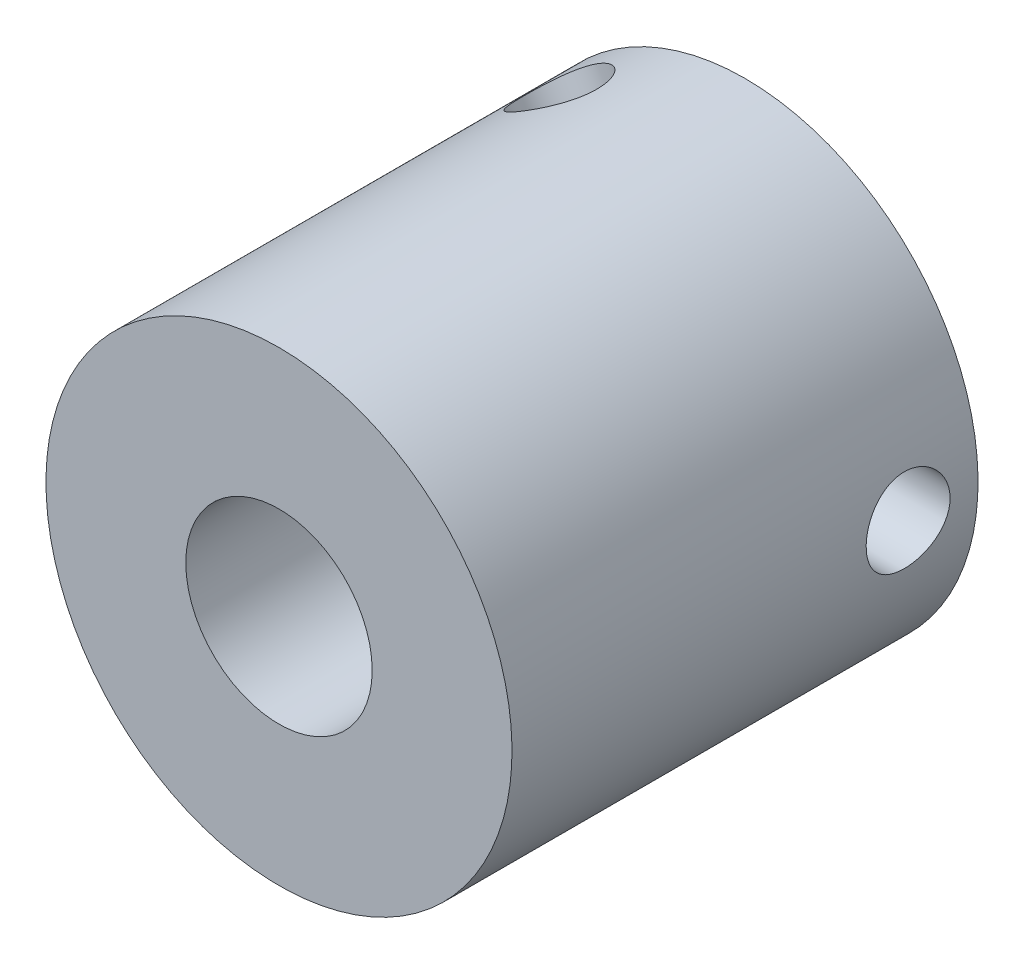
ISO-10303-21;
HEADER;
FILE_DESCRIPTION(('STEP AP214'),'2;1');
FILE_NAME('part.step','',(''),(''),'','','');
FILE_SCHEMA(('AUTOMOTIVE_DESIGN { 1 0 10303 214 1 1 1 1 }'));
ENDSEC;
DATA;
#1=APPLICATION_CONTEXT('core data for automotive mechanical design processes');
#2=APPLICATION_PROTOCOL_DEFINITION('international standard','automotive_design',2000,#1);
#3=PRODUCT_CONTEXT('',#1,'mechanical');
#4=PRODUCT('Part','Part','',(#3));
#5=PRODUCT_RELATED_PRODUCT_CATEGORY('part','',(#4));
#6=PRODUCT_DEFINITION_FORMATION('','',#4);
#7=PRODUCT_DEFINITION_CONTEXT('part definition',#1,'design');
#8=PRODUCT_DEFINITION('design','',#6,#7);
#9=PRODUCT_DEFINITION_SHAPE('','',#8);
#10=(LENGTH_UNIT() NAMED_UNIT(*) SI_UNIT(.MILLI.,.METRE.));
#11=(NAMED_UNIT(*) PLANE_ANGLE_UNIT() SI_UNIT($,.RADIAN.));
#12=(NAMED_UNIT(*) SI_UNIT($,.STERADIAN.) SOLID_ANGLE_UNIT());
#13=UNCERTAINTY_MEASURE_WITH_UNIT(LENGTH_MEASURE(1.E-05),#10,'distance_accuracy_value','');
#14=(GEOMETRIC_REPRESENTATION_CONTEXT(3) GLOBAL_UNCERTAINTY_ASSIGNED_CONTEXT((#13)) GLOBAL_UNIT_ASSIGNED_CONTEXT((#10,
#11,#12)) REPRESENTATION_CONTEXT('',''));
#15=CARTESIAN_POINT('',(0.,0.,0.));
#16=DIRECTION('',(0.,0.,1.));
#17=DIRECTION('',(1.,0.,0.));
#18=AXIS2_PLACEMENT_3D('',#15,#16,#17);
#19=CARTESIAN_POINT('',(0.,0.,-16.9705627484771));
#20=DIRECTION('',(0.,0.,1.));
#21=DIRECTION('',(1.,0.,0.));
#22=AXIS2_PLACEMENT_3D('',#19,#20,#21);
#23=CYLINDRICAL_SURFACE('',#22,4.);
#24=CARTESIAN_POINT('',(0.,0.,0.));
#25=DIRECTION('',(0.,0.,1.));
#26=DIRECTION('',(1.,0.,0.));
#27=AXIS2_PLACEMENT_3D('',#24,#25,#26);
#28=CIRCLE('',#27,4.);
#29=CARTESIAN_POINT('',(4.,0.,0.));
#30=VERTEX_POINT('',#29);
#31=EDGE_CURVE('E37',#30,#30,#28,.F.);
#32=ORIENTED_EDGE('',*,*,#31,.T.);
#33=EDGE_LOOP('',(#32));
#34=FACE_BOUND('',#33,.T.);
#35=CARTESIAN_POINT('',(0.,0.,20.));
#36=DIRECTION('',(0.,0.,1.));
#37=DIRECTION('',(1.,0.,0.));
#38=AXIS2_PLACEMENT_3D('',#35,#36,#37);
#39=CIRCLE('',#38,4.);
#40=CARTESIAN_POINT('',(4.,0.,20.));
#41=VERTEX_POINT('',#40);
#42=EDGE_CURVE('E70',#41,#41,#39,.T.);
#43=ORIENTED_EDGE('',*,*,#42,.T.);
#44=EDGE_LOOP('',(#43));
#45=FACE_BOUND('',#44,.T.);
#46=CARTESIAN_POINT('',(4.,0.,1.2));
#47=CARTESIAN_POINT('',(3.99999614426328,-0.0957257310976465,1.20000467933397));
#48=CARTESIAN_POINT('',(3.99652545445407,-0.191597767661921,1.20768115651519));
#49=CARTESIAN_POINT('',(3.98298685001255,-0.380576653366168,1.23807960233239));
#50=CARTESIAN_POINT('',(3.9729033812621,-0.473676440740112,1.26083704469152));
#51=CARTESIAN_POINT('',(3.94720826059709,-0.654078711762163,1.32036661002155));
#52=CARTESIAN_POINT('',(3.93161653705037,-0.741400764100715,1.35708824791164));
#53=CARTESIAN_POINT('',(3.89638931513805,-0.908546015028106,1.44327495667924));
#54=CARTESIAN_POINT('',(3.87675467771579,-0.988370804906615,1.49273731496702));
#55=CARTESIAN_POINT('',(3.83412363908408,-1.14291333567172,1.60594379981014));
#56=CARTESIAN_POINT('',(3.81100581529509,-1.21715266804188,1.67029477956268));
#57=CARTESIAN_POINT('',(3.7644874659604,-1.35420914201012,1.81016191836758));
#58=CARTESIAN_POINT('',(3.7410867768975,-1.41701930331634,1.88568484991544));
#59=CARTESIAN_POINT('',(3.69507447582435,-1.53315347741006,2.05118303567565));
#60=CARTESIAN_POINT('',(3.67259284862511,-1.58568979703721,2.14175112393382));
#61=CARTESIAN_POINT('',(3.6329325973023,-1.67457061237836,2.33158516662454));
#62=CARTESIAN_POINT('',(3.61575080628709,-1.71092478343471,2.43084588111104));
#63=CARTESIAN_POINT('',(3.5899719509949,-1.76435376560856,2.62975457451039));
#64=CARTESIAN_POINT('',(3.58096510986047,-1.78235522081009,2.72909825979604));
#65=CARTESIAN_POINT('',(3.57140297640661,-1.80144593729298,2.92977232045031));
#66=CARTESIAN_POINT('',(3.57084181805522,-1.80254693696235,3.03110126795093));
#67=CARTESIAN_POINT('',(3.5778937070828,-1.7884953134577,3.22286555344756));
#68=CARTESIAN_POINT('',(3.58475751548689,-1.77483260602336,3.31344356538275));
#69=CARTESIAN_POINT('',(3.6046018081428,-1.7341718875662,3.49084958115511));
#70=CARTESIAN_POINT('',(3.61758371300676,-1.70717077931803,3.57767670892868));
#71=CARTESIAN_POINT('',(3.64850272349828,-1.64006511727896,3.74747093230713));
#72=CARTESIAN_POINT('',(3.66654531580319,-1.59967786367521,3.83030621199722));
#73=CARTESIAN_POINT('',(3.70553830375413,-1.50715060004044,3.98837927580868));
#74=CARTESIAN_POINT('',(3.72648993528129,-1.45500558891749,4.06361380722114));
#75=CARTESIAN_POINT('',(3.77148635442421,-1.33432905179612,4.21228053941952));
#76=CARTESIAN_POINT('',(3.79563079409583,-1.26467952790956,4.28477790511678));
#77=CARTESIAN_POINT('',(3.84254971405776,-1.11401728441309,4.41740666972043));
#78=CARTESIAN_POINT('',(3.86532375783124,-1.03300097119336,4.47753414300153));
#79=CARTESIAN_POINT('',(3.90781142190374,-0.858658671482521,4.58541102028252));
#80=CARTESIAN_POINT('',(3.92740837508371,-0.765029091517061,4.63271925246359));
#81=CARTESIAN_POINT('',(3.96040579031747,-0.570031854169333,4.71057437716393));
#82=CARTESIAN_POINT('',(3.97381025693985,-0.468669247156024,4.74113210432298));
#83=CARTESIAN_POINT('',(3.99212554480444,-0.268840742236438,4.78252160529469));
#84=CARTESIAN_POINT('',(3.99757364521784,-0.170683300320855,4.79460408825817));
#85=CARTESIAN_POINT('',(4.00112518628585,0.0264022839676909,4.80250349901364));
#86=CARTESIAN_POINT('',(3.99923120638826,0.125330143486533,4.79832613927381));
#87=CARTESIAN_POINT('',(3.98864978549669,0.314885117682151,4.77466197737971));
#88=CARTESIAN_POINT('',(3.98037602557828,0.405654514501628,4.75610710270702));
#89=CARTESIAN_POINT('',(3.95834128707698,0.582660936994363,4.70557349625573));
#90=CARTESIAN_POINT('',(3.94457964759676,0.66889741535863,4.67359314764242));
#91=CARTESIAN_POINT('',(3.91232476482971,0.837442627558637,4.59610836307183));
#92=CARTESIAN_POINT('',(3.89369761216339,0.919545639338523,4.55021406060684));
#93=CARTESIAN_POINT('',(3.85362888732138,1.07518043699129,4.44662892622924));
#94=CARTESIAN_POINT('',(3.83218608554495,1.14870845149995,4.38893293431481));
#95=CARTESIAN_POINT('',(3.78656870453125,1.29149865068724,4.2578477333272));
#96=CARTESIAN_POINT('',(3.76231462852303,1.35990988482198,4.18355706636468));
#97=CARTESIAN_POINT('',(3.71528573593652,1.48359021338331,4.02427154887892));
#98=CARTESIAN_POINT('',(3.69251148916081,1.53885426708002,3.93927261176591));
#99=CARTESIAN_POINT('',(3.65057841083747,1.63589501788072,3.75807040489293));
#100=CARTESIAN_POINT('',(3.63152701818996,1.67729036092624,3.66163606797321));
#101=CARTESIAN_POINT('',(3.60052790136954,1.74285314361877,3.46202689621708));
#102=CARTESIAN_POINT('',(3.58857300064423,1.76703799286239,3.35885898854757));
#103=CARTESIAN_POINT('',(3.57434222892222,1.79563623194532,3.1582820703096));
#104=CARTESIAN_POINT('',(3.57132092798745,1.80157406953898,3.06114311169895));
#105=CARTESIAN_POINT('',(3.57326614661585,1.79771412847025,2.86727148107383));
#106=CARTESIAN_POINT('',(3.57823084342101,1.78791994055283,2.770538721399));
#107=CARTESIAN_POINT('',(3.59486173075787,1.75421876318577,2.58658574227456));
#108=CARTESIAN_POINT('',(3.60608465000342,1.73124262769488,2.49915066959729));
#109=CARTESIAN_POINT('',(3.63354977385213,1.67282749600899,2.32939442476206));
#110=CARTESIAN_POINT('',(3.64979343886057,1.63738487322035,2.24707474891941));
#111=CARTESIAN_POINT('',(3.686767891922,1.55242316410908,2.08404593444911));
#112=CARTESIAN_POINT('',(3.70772103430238,1.50214155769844,2.00378577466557));
#113=CARTESIAN_POINT('',(3.75123798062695,1.38990450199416,1.85236964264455));
#114=CARTESIAN_POINT('',(3.77380247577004,1.32794402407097,1.78121761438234));
#115=CARTESIAN_POINT('',(3.82045170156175,1.1874770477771,1.64337390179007));
#116=CARTESIAN_POINT('',(3.84448894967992,1.10798007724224,1.5776703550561));
#117=CARTESIAN_POINT('',(3.88939150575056,0.938258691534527,1.46042031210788));
#118=CARTESIAN_POINT('',(3.91025535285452,0.848029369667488,1.40888032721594));
#119=CARTESIAN_POINT('',(3.94631359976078,0.660057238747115,1.3222244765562));
#120=CARTESIAN_POINT('',(3.96156247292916,0.562398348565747,1.28694991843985));
#121=CARTESIAN_POINT('',(3.98487136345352,0.361825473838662,1.23370953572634));
#122=CARTESIAN_POINT('',(3.99295317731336,0.258928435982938,1.21569121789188));
#123=CARTESIAN_POINT('',(3.99798889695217,0.129468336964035,1.20447371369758));
#124=CARTESIAN_POINT('',(3.99874171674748,0.10361201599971,1.20279769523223));
#125=CARTESIAN_POINT('',(3.99974779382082,0.0518407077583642,1.20056019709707));
#126=CARTESIAN_POINT('',(4.00000104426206,0.0259257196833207,1.19999873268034));
#127=CARTESIAN_POINT('',(4.,0.,1.2));
#128=B_SPLINE_CURVE_WITH_KNOTS('',3,(#46,#47,#48,#49,#50,#51,#52,#53,#54,#55,#56,#57,#58,#59,
#60,#61,#62,#63,#64,#65,#66,#67,#68,#69,#70,#71,#72,#73,#74,#75,#76,#77,#78,#79,#80,#81,#82,#83,
#84,#85,#86,#87,#88,#89,#90,#91,#92,#93,#94,#95,#96,#97,#98,#99,#100,#101,#102,#103,#104,#105,
#106,#107,#108,#109,#110,#111,#112,#113,#114,#115,#116,#117,#118,#119,#120,#121,#122,#123,#124,
#125,#126,#127),.UNSPECIFIED.,.T.,.F.,(4,2,2,2,2,2,2,2,2,2,2,2,2,2,2,2,2,2,2,2,2,2,2,2,2,2,2,2,
2,2,2,2,2,2,2,2,2,2,2,2,4),(0.,0.28707077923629,0.574819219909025,0.861537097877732,
1.14819398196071,1.44969271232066,1.75137496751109,2.0710233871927,2.39048043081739,
2.69286202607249,2.9950335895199,3.26933192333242,3.54369398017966,3.82426477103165,
4.1049551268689,4.41375209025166,4.72264690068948,5.04111110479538,5.35936907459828,
5.65494364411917,5.9504143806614,6.22818822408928,6.50599552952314,6.79244743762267,
7.07902485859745,7.38921990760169,7.69953369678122,8.01778885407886,8.33572161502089,
8.62625158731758,8.91671525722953,9.18882532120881,9.461014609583,9.75081852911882,
10.0407475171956,10.3569438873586,10.6732853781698,10.9864715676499,11.2987019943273,
11.3764492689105,11.4541976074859),.UNSPECIFIED.);
#129=CARTESIAN_POINT('',(4.,0.,1.2));
#130=VERTEX_POINT('',#129);
#131=EDGE_CURVE('E56',#130,#130,#128,.T.);
#132=ORIENTED_EDGE('',*,*,#131,.F.);
#133=EDGE_LOOP('',(#132));
#134=FACE_BOUND('',#133,.T.);
#135=CARTESIAN_POINT('',(-0.227211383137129,3.9935416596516,3.));
#136=CARTESIAN_POINT('',(-0.227218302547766,3.99354391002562,3.09517059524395));
#137=CARTESIAN_POINT('',(-0.235719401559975,3.99308546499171,3.19049226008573));
#138=CARTESIAN_POINT('',(-0.269169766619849,3.99096656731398,3.37831810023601));
#139=CARTESIAN_POINT('',(-0.294160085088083,3.98930311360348,3.47081463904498));
#140=CARTESIAN_POINT('',(-0.358881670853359,3.98399837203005,3.64993289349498));
#141=CARTESIAN_POINT('',(-0.39854601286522,3.9803660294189,3.73657920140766));
#142=CARTESIAN_POINT('',(-0.490604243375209,3.97006866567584,3.90255257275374));
#143=CARTESIAN_POINT('',(-0.542996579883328,3.96340401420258,3.98188052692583));
#144=CARTESIAN_POINT('',(-0.662276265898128,3.94528306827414,4.13678782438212));
#145=CARTESIAN_POINT('',(-0.729893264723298,3.93353893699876,4.21177195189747));
#146=CARTESIAN_POINT('',(-0.874829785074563,3.90386266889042,4.35031925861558));
#147=CARTESIAN_POINT('',(-0.952153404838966,3.88592791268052,4.41387758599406));
#148=CARTESIAN_POINT('',(-1.1182542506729,3.84151862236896,4.53098864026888));
#149=CARTESIAN_POINT('',(-1.20741827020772,3.81464794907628,4.58384780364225));
#150=CARTESIAN_POINT('',(-1.39055829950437,3.7517592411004,4.67330158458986));
#151=CARTESIAN_POINT('',(-1.48453180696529,3.71574592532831,4.70990456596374));
#152=CARTESIAN_POINT('',(-1.668113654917,3.63686341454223,4.76357498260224));
#153=CARTESIAN_POINT('',(-1.75764896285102,3.59452975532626,4.78167535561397));
#154=CARTESIAN_POINT('',(-1.93467213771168,3.5024248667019,4.80118884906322));
#155=CARTESIAN_POINT('',(-2.02216096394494,3.45265720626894,4.80260995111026));
#156=CARTESIAN_POINT('',(-2.18611064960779,3.35105482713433,4.7892123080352));
#157=CARTESIAN_POINT('',(-2.26291377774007,3.29961566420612,4.77553576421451));
#158=CARTESIAN_POINT('',(-2.41031617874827,3.19352854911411,4.7343214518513));
#159=CARTESIAN_POINT('',(-2.48091499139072,3.13888035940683,4.70678265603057));
#160=CARTESIAN_POINT('',(-2.61560739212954,3.02759850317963,4.63833755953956));
#161=CARTESIAN_POINT('',(-2.67958588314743,2.97094728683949,4.5972345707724));
#162=CARTESIAN_POINT('',(-2.79905444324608,2.85867535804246,4.50304296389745));
#163=CARTESIAN_POINT('',(-2.85454139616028,2.80305503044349,4.44994996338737));
#164=CARTESIAN_POINT('',(-2.96080426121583,2.69074060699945,4.32835533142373));
#165=CARTESIAN_POINT('',(-3.01084529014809,2.63431824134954,4.25895934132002));
#166=CARTESIAN_POINT('',(-3.10056968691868,2.5281043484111,4.1091941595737));
#167=CARTESIAN_POINT('',(-3.14024764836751,2.47831628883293,4.0288192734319));
#168=CARTESIAN_POINT('',(-3.21072923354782,2.38636246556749,3.85501145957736));
#169=CARTESIAN_POINT('',(-3.24107063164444,2.34462356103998,3.76116205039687));
#170=CARTESIAN_POINT('',(-3.29033955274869,2.27497393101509,3.5656687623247));
#171=CARTESIAN_POINT('',(-3.30927678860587,2.24705144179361,3.46403159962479));
#172=CARTESIAN_POINT('',(-3.33466604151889,2.20918303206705,3.26360500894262));
#173=CARTESIAN_POINT('',(-3.34191671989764,2.19809055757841,3.16513489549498));
#174=CARTESIAN_POINT('',(-3.346388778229,2.19127950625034,2.96745655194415));
#175=CARTESIAN_POINT('',(-3.34361471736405,2.19555394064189,2.86824867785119));
#176=CARTESIAN_POINT('',(-3.32871118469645,2.21806943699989,2.6803198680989));
#177=CARTESIAN_POINT('',(-3.31734870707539,2.23516460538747,2.59139535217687));
#178=CARTESIAN_POINT('',(-3.28627752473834,2.28059896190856,2.41800027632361));
#179=CARTESIAN_POINT('',(-3.26656663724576,2.30894109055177,2.33353088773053));
#180=CARTESIAN_POINT('',(-3.21780525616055,2.37645363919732,2.1671614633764));
#181=CARTESIAN_POINT('',(-3.18837349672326,2.41605492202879,2.08554930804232));
#182=CARTESIAN_POINT('',(-3.12051504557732,2.50308375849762,1.93065310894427));
#183=CARTESIAN_POINT('',(-3.08208406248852,2.55051504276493,1.85737306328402));
#184=CARTESIAN_POINT('',(-2.9920101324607,2.65577152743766,1.71373956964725));
#185=CARTESIAN_POINT('',(-2.93944223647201,2.71415965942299,1.64437448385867));
#186=CARTESIAN_POINT('',(-2.82356538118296,2.83451073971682,1.51893876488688));
#187=CARTESIAN_POINT('',(-2.76025473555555,2.89647424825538,1.46287022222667));
#188=CARTESIAN_POINT('',(-2.62272212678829,3.02159644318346,1.3652830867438));
#189=CARTESIAN_POINT('',(-2.54839776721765,3.08476088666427,1.32391497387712));
#190=CARTESIAN_POINT('',(-2.39065699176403,3.20854811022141,1.25825900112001));
#191=CARTESIAN_POINT('',(-2.30724703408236,3.26917265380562,1.23395909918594));
#192=CARTESIAN_POINT('',(-2.14051533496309,3.38044961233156,1.20482316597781));
#193=CARTESIAN_POINT('',(-2.05770803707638,3.43151149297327,1.19860012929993));
#194=CARTESIAN_POINT('',(-1.88882018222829,3.52728977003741,1.20192704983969));
#195=CARTESIAN_POINT('',(-1.80274038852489,3.5720076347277,1.21147335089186));
#196=CARTESIAN_POINT('',(-1.63414770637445,3.65210603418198,1.24508188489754));
#197=CARTESIAN_POINT('',(-1.55165419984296,3.6878230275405,1.26845156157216));
#198=CARTESIAN_POINT('',(-1.3886876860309,3.7522300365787,1.32822270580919));
#199=CARTESIAN_POINT('',(-1.30821502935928,3.78091884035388,1.3646264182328));
#200=CARTESIAN_POINT('',(-1.14794735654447,3.8327058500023,1.45125977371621));
#201=CARTESIAN_POINT('',(-1.06835218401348,3.85548782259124,1.50204628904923));
#202=CARTESIAN_POINT('',(-0.916112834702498,3.89447337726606,1.61524486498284));
#203=CARTESIAN_POINT('',(-0.843471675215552,3.91067411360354,1.67766193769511));
#204=CARTESIAN_POINT('',(-0.701783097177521,3.93867104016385,1.81826693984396));
#205=CARTESIAN_POINT('',(-0.633502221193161,3.95000469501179,1.89732236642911));
#206=CARTESIAN_POINT('',(-0.510273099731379,3.96780927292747,2.06582014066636));
#207=CARTESIAN_POINT('',(-0.455333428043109,3.97427707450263,2.15526911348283));
#208=CARTESIAN_POINT('',(-0.36134166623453,3.98392887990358,2.34304751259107));
#209=CARTESIAN_POINT('',(-0.322387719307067,3.98709277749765,2.44142739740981));
#210=CARTESIAN_POINT('',(-0.263587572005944,3.99141790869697,2.64360393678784));
#211=CARTESIAN_POINT('',(-0.243677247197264,3.99258587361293,2.74738116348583));
#212=CARTESIAN_POINT('',(-0.231758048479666,3.99328022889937,2.87652984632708));
#213=CARTESIAN_POINT('',(-0.230055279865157,3.99337897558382,2.90118976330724));
#214=CARTESIAN_POINT('',(-0.227781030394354,3.99350939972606,2.95056305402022));
#215=CARTESIAN_POINT('',(-0.227209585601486,3.99354107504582,2.975276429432));
#216=CARTESIAN_POINT('',(-0.227211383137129,3.9935416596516,3.));
#217=B_SPLINE_CURVE_WITH_KNOTS('',3,(#135,#136,#137,#138,#139,#140,#141,#142,#143,#144,#145,
#146,#147,#148,#149,#150,#151,#152,#153,#154,#155,#156,#157,#158,#159,#160,#161,#162,#163,#164,
#165,#166,#167,#168,#169,#170,#171,#172,#173,#174,#175,#176,#177,#178,#179,#180,#181,#182,#183,
#184,#185,#186,#187,#188,#189,#190,#191,#192,#193,#194,#195,#196,#197,#198,#199,#200,#201,#202,
#203,#204,#205,#206,#207,#208,#209,#210,#211,#212,#213,#214,#215,#216),.UNSPECIFIED.,.T.,.F.,(4,
2,2,2,2,2,2,2,2,2,2,2,2,2,2,2,2,2,2,2,2,2,2,2,2,2,2,2,2,2,2,2,2,2,2,2,2,2,2,2,4),(0.,
0.285407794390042,0.571528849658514,0.856360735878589,1.1411579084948,1.44479681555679,
1.74856435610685,2.06815358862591,2.38757820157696,2.68799375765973,2.98826554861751,
3.26728664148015,3.54632841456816,3.82960860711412,4.11299250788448,4.41910720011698,
4.72538127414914,5.04500587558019,5.36435786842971,5.66078533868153,5.9570780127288,
6.22964286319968,6.50227902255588,6.78721618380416,7.07228949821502,7.38526327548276,
7.6982862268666,8.01442689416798,8.33034429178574,8.62128368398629,8.91215563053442,
9.18956012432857,9.46701241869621,9.75717220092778,10.0474573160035,10.3612338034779,
10.6752114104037,10.9910888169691,11.3058988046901,11.3800401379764,11.4541838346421),.UNSPECIFIED.);
#218=CARTESIAN_POINT('',(-0.227211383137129,3.9935416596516,3.));
#219=VERTEX_POINT('',#218);
#220=EDGE_CURVE('E61',#219,#219,#217,.T.);
#221=ORIENTED_EDGE('',*,*,#220,.F.);
#222=EDGE_LOOP('',(#221));
#223=FACE_BOUND('',#222,.T.);
#224=ADVANCED_FACE('F12',(#34,#45,#134,#223),#23,.F.);
#225=CARTESIAN_POINT('',(10.,0.,3.));
#226=DIRECTION('',(1.,0.,0.));
#227=DIRECTION('',(0.,0.,1.));
#228=AXIS2_PLACEMENT_3D('',#225,#226,#227);
#229=CYLINDRICAL_SURFACE('',#228,1.8);
#230=CARTESIAN_POINT('',(10.,0.,1.2));
#231=CARTESIAN_POINT('',(9.99999792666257,-0.100138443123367,1.20000468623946));
#232=CARTESIAN_POINT('',(9.99847890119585,-0.200403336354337,1.20839204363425));
#233=CARTESIAN_POINT('',(9.99256124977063,-0.398189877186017,1.2417225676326));
#234=CARTESIAN_POINT('',(9.98815683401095,-0.495705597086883,1.26669902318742));
#235=CARTESIAN_POINT('',(9.97696172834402,-0.684989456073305,1.33242473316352));
#236=CARTESIAN_POINT('',(9.9701741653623,-0.776764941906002,1.37315332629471));
#237=CARTESIAN_POINT('',(9.95495763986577,-0.952142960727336,1.46917704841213));
#238=CARTESIAN_POINT('',(9.9465292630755,-1.03574839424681,1.52446698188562));
#239=CARTESIAN_POINT('',(9.92885621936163,-1.19338882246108,1.64870648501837));
#240=CARTESIAN_POINT('',(9.91960421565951,-1.26731946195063,1.7177874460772));
#241=CARTESIAN_POINT('',(9.90138142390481,-1.40261092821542,1.86736851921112));
#242=CARTESIAN_POINT('',(9.89241066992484,-1.46397023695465,1.94787000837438));
#243=CARTESIAN_POINT('',(9.87569637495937,-1.57279517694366,2.11872462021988));
#244=CARTESIAN_POINT('',(9.86796217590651,-1.6201571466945,2.20914476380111));
#245=CARTESIAN_POINT('',(9.85469826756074,-1.69897904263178,2.39681974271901));
#246=CARTESIAN_POINT('',(9.84916836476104,-1.73044036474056,2.49407397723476));
#247=CARTESIAN_POINT('',(9.84101185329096,-1.77623939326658,2.6915561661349));
#248=CARTESIAN_POINT('',(9.8383548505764,-1.79075649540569,2.79174123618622));
#249=CARTESIAN_POINT('',(9.83615323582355,-1.80281159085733,2.99315783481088));
#250=CARTESIAN_POINT('',(9.83660837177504,-1.80035095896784,3.09438927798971));
#251=CARTESIAN_POINT('',(9.84055190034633,-1.77866619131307,3.29373143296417));
#252=CARTESIAN_POINT('',(9.84400352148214,-1.75964526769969,3.39186508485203));
#253=CARTESIAN_POINT('',(9.85349347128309,-1.70569919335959,3.5835259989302));
#254=CARTESIAN_POINT('',(9.85953192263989,-1.67077328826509,3.67705304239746));
#255=CARTESIAN_POINT('',(9.87355429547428,-1.58580593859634,3.85744754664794));
#256=CARTESIAN_POINT('',(9.88154890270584,-1.53568109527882,3.94427486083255));
#257=CARTESIAN_POINT('',(9.89857482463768,-1.42180184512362,4.10835629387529));
#258=CARTESIAN_POINT('',(9.90760615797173,-1.35804719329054,4.18561024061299));
#259=CARTESIAN_POINT('',(9.92584751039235,-1.21763063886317,4.32952111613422));
#260=CARTESIAN_POINT('',(9.93505823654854,-1.14079701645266,4.39601049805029));
#261=CARTESIAN_POINT('',(9.95250580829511,-0.976936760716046,4.51520980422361));
#262=CARTESIAN_POINT('',(9.96074222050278,-0.889905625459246,4.56791360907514));
#263=CARTESIAN_POINT('',(9.97532870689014,-0.707929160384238,4.65806284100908));
#264=CARTESIAN_POINT('',(9.98167520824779,-0.612969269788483,4.69547941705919));
#265=CARTESIAN_POINT('',(9.99172969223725,-0.418096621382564,4.75370936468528));
#266=CARTESIAN_POINT('',(9.99544322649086,-0.318194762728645,4.77455768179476));
#267=CARTESIAN_POINT('',(9.99842222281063,-0.181296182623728,4.79121663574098));
#268=CARTESIAN_POINT('',(9.99901260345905,-0.145122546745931,4.79450767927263));
#269=CARTESIAN_POINT('',(9.99980186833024,-0.0726381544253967,4.7989002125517));
#270=CARTESIAN_POINT('',(10.0000007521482,-0.0363273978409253,4.80000170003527));
#271=CARTESIAN_POINT('',(9.99999792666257,0.100138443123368,4.79999531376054));
#272=CARTESIAN_POINT('',(9.99847890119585,0.200403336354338,4.79160795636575));
#273=CARTESIAN_POINT('',(9.99256124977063,0.398189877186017,4.7582774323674));
#274=CARTESIAN_POINT('',(9.98815683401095,0.495705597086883,4.73330097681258));
#275=CARTESIAN_POINT('',(9.97696172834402,0.684989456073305,4.66757526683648));
#276=CARTESIAN_POINT('',(9.9701741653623,0.776764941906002,4.62684667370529));
#277=CARTESIAN_POINT('',(9.95495763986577,0.952142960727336,4.53082295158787));
#278=CARTESIAN_POINT('',(9.9465292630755,1.03574839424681,4.47553301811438));
#279=CARTESIAN_POINT('',(9.92885621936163,1.19338882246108,4.35129351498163));
#280=CARTESIAN_POINT('',(9.91960421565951,1.26731946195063,4.2822125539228));
#281=CARTESIAN_POINT('',(9.90138142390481,1.40261092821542,4.13263148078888));
#282=CARTESIAN_POINT('',(9.89241066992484,1.46397023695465,4.05212999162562));
#283=CARTESIAN_POINT('',(9.87569637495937,1.57279517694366,3.88127537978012));
#284=CARTESIAN_POINT('',(9.86796217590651,1.6201571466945,3.79085523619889));
#285=CARTESIAN_POINT('',(9.85469826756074,1.69897904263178,3.60318025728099));
#286=CARTESIAN_POINT('',(9.84916836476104,1.73044036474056,3.50592602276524));
#287=CARTESIAN_POINT('',(9.84101185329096,1.77623939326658,3.3084438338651));
#288=CARTESIAN_POINT('',(9.8383548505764,1.79075649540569,3.20825876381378));
#289=CARTESIAN_POINT('',(9.83615323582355,1.80281159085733,3.00684216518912));
#290=CARTESIAN_POINT('',(9.83660837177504,1.80035095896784,2.90561072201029));
#291=CARTESIAN_POINT('',(9.84055190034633,1.77866619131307,2.70626856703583));
#292=CARTESIAN_POINT('',(9.84400352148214,1.75964526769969,2.60813491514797));
#293=CARTESIAN_POINT('',(9.85349347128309,1.70569919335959,2.4164740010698));
#294=CARTESIAN_POINT('',(9.85953192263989,1.67077328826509,2.32294695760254));
#295=CARTESIAN_POINT('',(9.87355429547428,1.58580593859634,2.14255245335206));
#296=CARTESIAN_POINT('',(9.88154890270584,1.53568109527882,2.05572513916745));
#297=CARTESIAN_POINT('',(9.89857482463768,1.42180184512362,1.89164370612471));
#298=CARTESIAN_POINT('',(9.90760615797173,1.35804719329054,1.81438975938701));
#299=CARTESIAN_POINT('',(9.92584751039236,1.21763063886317,1.67047888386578));
#300=CARTESIAN_POINT('',(9.93505823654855,1.14079701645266,1.60398950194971));
#301=CARTESIAN_POINT('',(9.95250580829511,0.976936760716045,1.48479019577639));
#302=CARTESIAN_POINT('',(9.96074222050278,0.889905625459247,1.43208639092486));
#303=CARTESIAN_POINT('',(9.97532870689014,0.707929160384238,1.34193715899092));
#304=CARTESIAN_POINT('',(9.98167520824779,0.612969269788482,1.30452058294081));
#305=CARTESIAN_POINT('',(9.99172969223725,0.418096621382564,1.24629063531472));
#306=CARTESIAN_POINT('',(9.99544322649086,0.318194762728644,1.22544231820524));
#307=CARTESIAN_POINT('',(9.99842222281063,0.181296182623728,1.20878336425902));
#308=CARTESIAN_POINT('',(9.99901260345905,0.145122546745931,1.20549232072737));
#309=CARTESIAN_POINT('',(9.99980186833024,0.0726381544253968,1.2010997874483));
#310=CARTESIAN_POINT('',(10.0000007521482,0.0363273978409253,1.19999829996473));
#311=CARTESIAN_POINT('',(10.,0.,1.2));
#312=B_SPLINE_CURVE_WITH_KNOTS('',3,(#230,#231,#232,#233,#234,#235,#236,#237,#238,#239,#240,
#241,#242,#243,#244,#245,#246,#247,#248,#249,#250,#251,#252,#253,#254,#255,#256,#257,#258,#259,
#260,#261,#262,#263,#264,#265,#266,#267,#268,#269,#270,#271,#272,#273,#274,#275,#276,#277,#278,
#279,#280,#281,#282,#283,#284,#285,#286,#287,#288,#289,#290,#291,#292,#293,#294,#295,#296,#297,
#298,#299,#300,#301,#302,#303,#304,#305,#306,#307,#308,#309,#310,#311),.UNSPECIFIED.,.T.,.F.,(4,
2,2,2,2,2,2,2,2,2,2,2,2,2,2,2,2,2,2,2,2,2,2,2,2,2,2,2,2,2,2,2,2,2,2,2,2,2,2,2,4),(0.,
0.300276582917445,0.601157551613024,0.901645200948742,1.20202578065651,1.50541792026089,
1.808846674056,2.11446927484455,2.42006504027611,2.72239510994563,3.02470069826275,
3.3233481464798,3.62200976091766,3.92234077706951,4.22267719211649,4.52731338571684,
4.83208457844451,5.13742832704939,5.44212632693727,5.55105807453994,5.65998993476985,
5.9602665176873,6.26114748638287,6.56163513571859,6.86201571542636,7.16540785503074,
7.46883660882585,7.7744592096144,8.08005497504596,8.38238504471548,8.6846906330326,
8.98333808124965,9.28199969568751,9.58233071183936,9.88266712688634,10.1873033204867,
10.4920745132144,10.7974182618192,11.1021162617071,11.2110480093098,11.3199798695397),.UNSPECIFIED.);
#313=CARTESIAN_POINT('',(10.,0.,1.2));
#314=VERTEX_POINT('',#313);
#315=EDGE_CURVE('E17',#314,#314,#312,.T.);
#316=ORIENTED_EDGE('',*,*,#315,.F.);
#317=EDGE_LOOP('',(#316));
#318=FACE_BOUND('',#317,.T.);
#319=ORIENTED_EDGE('',*,*,#131,.T.);
#320=EDGE_LOOP('',(#319));
#321=FACE_BOUND('',#320,.T.);
#322=ADVANCED_FACE('F14',(#318,#321),#229,.F.);
#323=CARTESIAN_POINT('',(0.,0.,20.));
#324=DIRECTION('',(0.,0.,1.));
#325=DIRECTION('',(0.,-1.,0.));
#326=AXIS2_PLACEMENT_3D('',#323,#324,#325);
#327=PLANE('',#326);
#328=CARTESIAN_POINT('',(0.,0.,20.));
#329=DIRECTION('',(0.,0.,-1.));
#330=DIRECTION('',(0.,1.,0.));
#331=AXIS2_PLACEMENT_3D('',#328,#329,#330);
#332=CIRCLE('',#331,10.);
#333=CARTESIAN_POINT('',(0.,10.,20.));
#334=VERTEX_POINT('',#333);
#335=EDGE_CURVE('E30',#334,#334,#332,.T.);
#336=ORIENTED_EDGE('',*,*,#335,.F.);
#337=EDGE_LOOP('',(#336));
#338=FACE_BOUND('',#337,.T.);
#339=ORIENTED_EDGE('',*,*,#42,.F.);
#340=EDGE_LOOP('',(#339));
#341=FACE_BOUND('',#340,.T.);
#342=ADVANCED_FACE('F84',(#338,#341),#327,.T.);
#343=CARTESIAN_POINT('',(0.,0.,0.));
#344=DIRECTION('',(0.,0.,1.));
#345=DIRECTION('',(0.,-1.,0.));
#346=AXIS2_PLACEMENT_3D('',#343,#344,#345);
#347=PLANE('',#346);
#348=CARTESIAN_POINT('',(0.,0.,0.));
#349=DIRECTION('',(0.,0.,-1.));
#350=DIRECTION('',(0.,1.,0.));
#351=AXIS2_PLACEMENT_3D('',#348,#349,#350);
#352=CIRCLE('',#351,10.);
#353=CARTESIAN_POINT('',(0.,10.,0.));
#354=VERTEX_POINT('',#353);
#355=EDGE_CURVE('E25',#354,#354,#352,.F.);
#356=ORIENTED_EDGE('',*,*,#355,.F.);
#357=EDGE_LOOP('',(#356));
#358=FACE_BOUND('',#357,.T.);
#359=ORIENTED_EDGE('',*,*,#31,.F.);
#360=EDGE_LOOP('',(#359));
#361=FACE_BOUND('',#360,.T.);
#362=ADVANCED_FACE('F87',(#358,#361),#347,.F.);
#363=CARTESIAN_POINT('',(-5.,8.66025403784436,3.));
#364=DIRECTION('',(-0.5,0.866025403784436,0.));
#365=DIRECTION('',(-0.866025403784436,-0.5,0.));
#366=AXIS2_PLACEMENT_3D('',#363,#364,#365);
#367=CYLINDRICAL_SURFACE('',#366,1.8);
#368=CARTESIAN_POINT('',(-6.4771787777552,7.6188027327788,3.));
#369=CARTESIAN_POINT('',(-6.47717580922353,7.61880698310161,2.89987639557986));
#370=CARTESIAN_POINT('',(-6.47068644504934,7.62433700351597,2.79962624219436));
#371=CARTESIAN_POINT('',(-6.44483457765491,7.64620053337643,2.60187040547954));
#372=CARTESIAN_POINT('',(-6.42544614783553,7.66255580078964,2.50437066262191));
#373=CARTESIAN_POINT('',(-6.37421453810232,7.70522498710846,2.31512059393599));
#374=CARTESIAN_POINT('',(-6.34238797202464,7.7315256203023,2.22336278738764));
#375=CARTESIAN_POINT('',(-6.26693437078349,7.79280979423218,2.04801451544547));
#376=CARTESIAN_POINT('',(-6.22331151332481,7.82779026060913,1.96442117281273));
#377=CARTESIAN_POINT('',(-6.1246056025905,7.90526230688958,1.8067676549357));
#378=CARTESIAN_POINT('',(-6.06940820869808,7.94782813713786,1.73281553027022));
#379=CARTESIAN_POINT('',(-5.94895032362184,8.03838649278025,1.5974824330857));
#380=CARTESIAN_POINT('',(-5.8836886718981,8.08637964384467,1.5361029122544));
#381=CARTESIAN_POINT('',(-5.74401420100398,8.18619010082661,1.42725636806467));
#382=CARTESIAN_POINT('',(-5.66954069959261,8.2380317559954,1.37988942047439));
#383=CARTESIAN_POINT('',(-5.5135724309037,8.34322213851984,1.30105739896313));
#384=CARTESIAN_POINT('',(-5.43207825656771,8.39657073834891,1.26959098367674));
#385=CARTESIAN_POINT('',(-5.26508535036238,8.50226626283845,1.22378199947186));
#386=CARTESIAN_POINT('',(-5.17963895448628,8.55461779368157,1.20925935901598));
#387=CARTESIAN_POINT('',(-5.00630940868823,8.6571937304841,1.19718952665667));
#388=CARTESIAN_POINT('',(-4.91842644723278,8.70741830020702,1.19964102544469));
#389=CARTESIAN_POINT('',(-4.74381824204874,8.80375038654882,1.22131086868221));
#390=CARTESIAN_POINT('',(-4.65709135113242,8.84989875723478,1.24033521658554));
#391=CARTESIAN_POINT('',(-4.48634526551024,8.93766900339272,1.29430467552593));
#392=CARTESIAN_POINT('',(-4.40232618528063,8.97929068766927,1.3292504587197));
#393=CARTESIAN_POINT('',(-4.23910830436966,9.05749423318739,1.41425989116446));
#394=CARTESIAN_POINT('',(-4.15993732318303,9.09404829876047,1.46440245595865));
#395=CARTESIAN_POINT('',(-4.00935476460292,9.16143489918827,1.57832003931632));
#396=CARTESIAN_POINT('',(-3.93794332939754,9.19226732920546,1.64209530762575));
#397=CARTESIAN_POINT('',(-3.80421461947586,9.24842115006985,1.78252710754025));
#398=CARTESIAN_POINT('',(-3.74203819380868,9.27365961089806,1.85935101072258));
#399=CARTESIAN_POINT('',(-3.63008074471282,9.31805527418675,2.02318310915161));
#400=CARTESIAN_POINT('',(-3.58030527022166,9.33720975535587,2.11019583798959));
#401=CARTESIAN_POINT('',(-3.49488097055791,9.36952004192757,2.29216608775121));
#402=CARTESIAN_POINT('',(-3.45926435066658,9.38266218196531,2.38714113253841));
#403=CARTESIAN_POINT('',(-3.40374434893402,9.40294697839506,2.58204697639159));
#404=CARTESIAN_POINT('',(-3.3838078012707,9.4101022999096,2.68196683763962));
#405=CARTESIAN_POINT('',(-3.36788185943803,9.41580493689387,2.81885406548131));
#406=CARTESIAN_POINT('',(-3.36473694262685,9.41692892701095,2.85499777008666));
#407=CARTESIAN_POINT('',(-3.36053873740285,9.41842790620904,2.9274221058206));
#408=CARTESIAN_POINT('',(-3.3594854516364,9.41880289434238,2.96370273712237));
#409=CARTESIAN_POINT('',(-3.35949248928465,9.41880228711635,3.10012360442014));
#410=CARTESIAN_POINT('',(-3.36752630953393,9.41594734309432,3.20037375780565));
#411=CARTESIAN_POINT('',(-3.39938661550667,9.40449073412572,3.39812959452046));
#412=CARTESIAN_POINT('',(-3.42324490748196,9.39587749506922,3.49562933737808));
#413=CARTESIAN_POINT('',(-3.48581331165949,9.37284421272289,3.68487940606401));
#414=CARTESIAN_POINT('',(-3.52450361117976,9.35843191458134,3.77663721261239));
#415=CARTESIAN_POINT('',(-3.61530406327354,9.32372926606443,3.95198548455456));
#416=CARTESIAN_POINT('',(-3.66740946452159,9.303440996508,4.03557882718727));
#417=CARTESIAN_POINT('',(-3.7838551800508,9.25669519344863,4.1932323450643));
#418=CARTESIAN_POINT('',(-3.84831696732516,9.23017576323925,4.26718446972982));
#419=CARTESIAN_POINT('',(-3.98697174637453,9.17113535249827,4.40251756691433));
#420=CARTESIAN_POINT('',(-4.06116586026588,9.13861367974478,4.4638970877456));
#421=CARTESIAN_POINT('',(-4.21744148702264,9.06755726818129,4.57274363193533));
#422=CARTESIAN_POINT('',(-4.29957442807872,9.02898215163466,4.62011057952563));
#423=CARTESIAN_POINT('',(-4.46865610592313,8.94650486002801,4.6989426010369));
#424=CARTESIAN_POINT('',(-4.55560443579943,8.90260313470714,4.73040901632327));
#425=CARTESIAN_POINT('',(-4.73063589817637,8.81083079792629,4.77621800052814));
#426=CARTESIAN_POINT('',(-4.81869685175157,8.76300781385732,4.79074064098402));
#427=CARTESIAN_POINT('',(-4.99419499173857,8.66418799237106,4.80281047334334));
#428=CARTESIAN_POINT('',(-5.08163222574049,8.6131914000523,4.80035897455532));
#429=CARTESIAN_POINT('',(-5.25236236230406,8.51014230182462,4.77868913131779));
#430=CARTESIAN_POINT('',(-5.33569146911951,8.45810879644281,4.75966478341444));
#431=CARTESIAN_POINT('',(-5.4970757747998,8.35412347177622,4.70569532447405));
#432=CARTESIAN_POINT('',(-5.57513075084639,8.30217165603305,4.6707495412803));
#433=CARTESIAN_POINT('',(-5.72446594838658,8.19992259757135,4.58574010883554));
#434=CARTESIAN_POINT('',(-5.79570818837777,8.14963554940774,4.53559754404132));
#435=CARTESIAN_POINT('',(-5.92935797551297,8.0529205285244,4.42167996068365));
#436=CARTESIAN_POINT('',(-5.99176536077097,8.0064926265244,4.35790469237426));
#437=CARTESIAN_POINT('',(-6.10726035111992,7.91875707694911,4.21747289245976));
#438=CARTESIAN_POINT('',(-6.16020571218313,7.87752994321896,4.14064898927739));
#439=CARTESIAN_POINT('',(-6.25463220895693,7.80276977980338,3.97681689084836));
#440=CARTESIAN_POINT('',(-6.29610821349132,7.76924019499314,3.88980416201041));
#441=CARTESIAN_POINT('',(-6.36680189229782,7.71141572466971,3.7078339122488));
#442=CARTESIAN_POINT('',(-6.39599162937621,7.68714189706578,3.61285886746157));
#443=CARTESIAN_POINT('',(-6.44131877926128,7.64920256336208,3.41795302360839));
#444=CARTESIAN_POINT('',(-6.45748374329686,7.6355146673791,3.31803316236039));
#445=CARTESIAN_POINT('',(-6.47038534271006,7.624573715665,3.18114593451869));
#446=CARTESIAN_POINT('',(-6.47293120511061,7.6224121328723,3.14500222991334));
#447=CARTESIAN_POINT('',(-6.4763284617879,7.61952587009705,3.0725778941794));
#448=CARTESIAN_POINT('',(-6.47717985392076,7.61880119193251,3.03629726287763));
#449=CARTESIAN_POINT('',(-6.4771787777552,7.6188027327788,3.));
#450=B_SPLINE_CURVE_WITH_KNOTS('',3,(#368,#369,#370,#371,#372,#373,#374,#375,#376,#377,#378,
#379,#380,#381,#382,#383,#384,#385,#386,#387,#388,#389,#390,#391,#392,#393,#394,#395,#396,#397,
#398,#399,#400,#401,#402,#403,#404,#405,#406,#407,#408,#409,#410,#411,#412,#413,#414,#415,#416,
#417,#418,#419,#420,#421,#422,#423,#424,#425,#426,#427,#428,#429,#430,#431,#432,#433,#434,#435,
#436,#437,#438,#439,#440,#441,#442,#443,#444,#445,#446,#447,#448,#449),.UNSPECIFIED.,.T.,.F.,(4,
2,2,2,2,2,2,2,2,2,2,2,2,2,2,2,2,2,2,2,2,2,2,2,2,2,2,2,2,2,2,2,2,2,2,2,2,2,2,2,4),(0.,
0.300232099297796,0.601069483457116,0.901506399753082,1.2018370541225,1.50528752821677,
1.8087730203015,2.11437635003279,2.41995389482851,2.72225341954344,3.02452962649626,
3.32331431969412,3.62211162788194,3.92248795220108,4.22286977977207,4.52744433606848,
4.83215493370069,5.13755470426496,5.44230675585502,5.55114811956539,5.65998962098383,
5.96022172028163,6.26105910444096,6.56149602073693,6.86182667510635,7.16527714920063,
7.46876264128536,7.77436597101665,8.07994351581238,8.3822430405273,8.68451924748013,
8.98330394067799,9.28210124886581,9.58247757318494,9.88285940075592,10.1874339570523,
10.4921445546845,10.7975443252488,11.1022963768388,11.2111377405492,11.3199792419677),.UNSPECIFIED.);
#451=CARTESIAN_POINT('',(-6.4771787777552,7.6188027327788,3.));
#452=VERTEX_POINT('',#451);
#453=EDGE_CURVE('E8',#452,#452,#450,.T.);
#454=ORIENTED_EDGE('',*,*,#453,.F.);
#455=EDGE_LOOP('',(#454));
#456=FACE_BOUND('',#455,.T.);
#457=ORIENTED_EDGE('',*,*,#220,.T.);
#458=EDGE_LOOP('',(#457));
#459=FACE_BOUND('',#458,.T.);
#460=ADVANCED_FACE('F39',(#456,#459),#367,.F.);
#461=CARTESIAN_POINT('',(0.,0.,20.));
#462=DIRECTION('',(0.,0.,-1.));
#463=DIRECTION('',(0.,1.,0.));
#464=AXIS2_PLACEMENT_3D('',#461,#462,#463);
#465=CYLINDRICAL_SURFACE('',#464,10.);
#466=ORIENTED_EDGE('',*,*,#335,.T.);
#467=EDGE_LOOP('',(#466));
#468=FACE_BOUND('',#467,.T.);
#469=ORIENTED_EDGE('',*,*,#453,.T.);
#470=EDGE_LOOP('',(#469));
#471=FACE_BOUND('',#470,.T.);
#472=ORIENTED_EDGE('',*,*,#355,.T.);
#473=EDGE_LOOP('',(#472));
#474=FACE_BOUND('',#473,.T.);
#475=ORIENTED_EDGE('',*,*,#315,.T.);
#476=EDGE_LOOP('',(#475));
#477=FACE_BOUND('',#476,.T.);
#478=ADVANCED_FACE('F42',(#468,#471,#474,#477),#465,.T.);
#479=CLOSED_SHELL('',(#224,#322,#342,#362,#460,#478));
#480=MANIFOLD_SOLID_BREP('B1',#479);
#481=ADVANCED_BREP_SHAPE_REPRESENTATION('',(#18,#480),#14);
#482=SHAPE_DEFINITION_REPRESENTATION(#9,#481);
ENDSEC;
END-ISO-10303-21;
